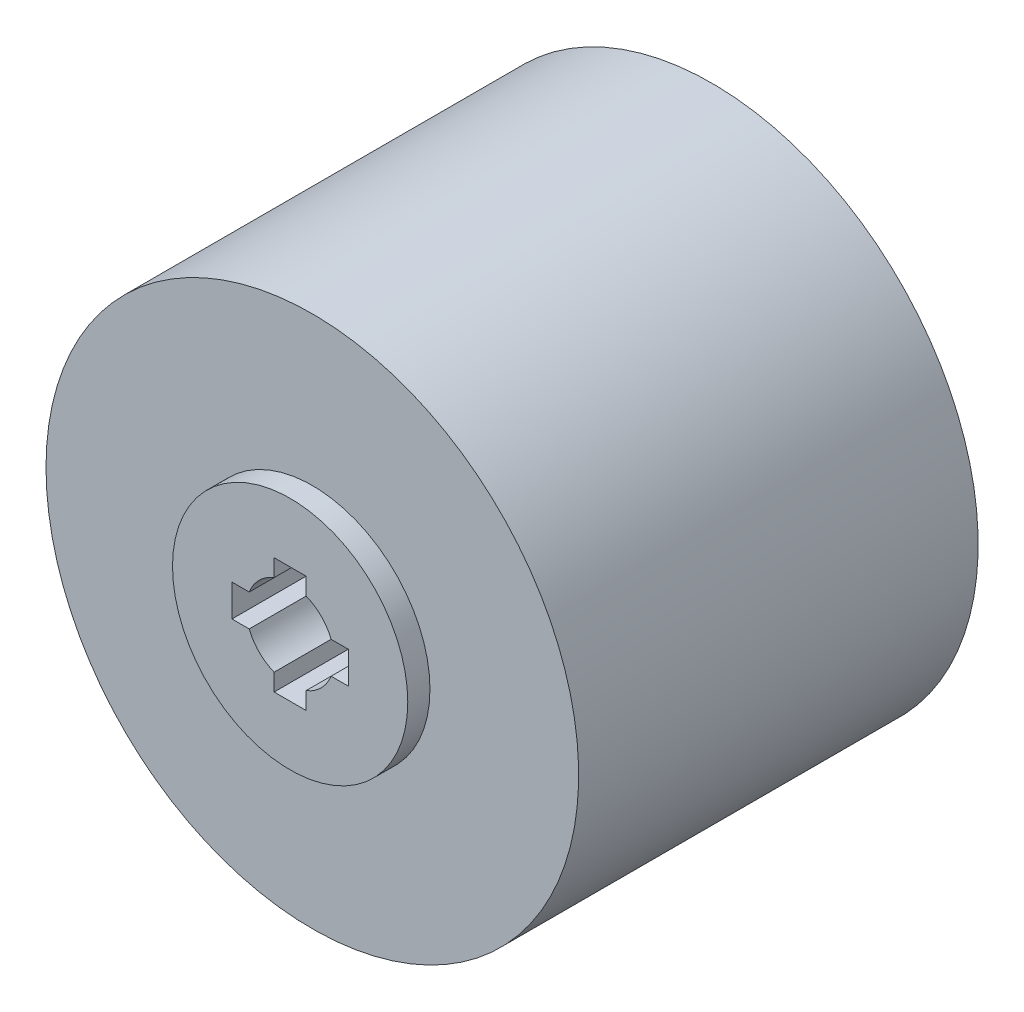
ISO-10303-21;
HEADER;
FILE_DESCRIPTION(('STEP AP214'),'2;1');
FILE_NAME('part.step','',(''),(''),'','','');
FILE_SCHEMA(('AUTOMOTIVE_DESIGN { 1 0 10303 214 1 1 1 1 }'));
ENDSEC;
DATA;
#1=APPLICATION_CONTEXT('core data for automotive mechanical design processes');
#2=APPLICATION_PROTOCOL_DEFINITION('international standard','automotive_design',2000,#1);
#3=PRODUCT_CONTEXT('',#1,'mechanical');
#4=PRODUCT('Part','Part','',(#3));
#5=PRODUCT_RELATED_PRODUCT_CATEGORY('part','',(#4));
#6=PRODUCT_DEFINITION_FORMATION('','',#4);
#7=PRODUCT_DEFINITION_CONTEXT('part definition',#1,'design');
#8=PRODUCT_DEFINITION('design','',#6,#7);
#9=PRODUCT_DEFINITION_SHAPE('','',#8);
#10=(LENGTH_UNIT() NAMED_UNIT(*) SI_UNIT(.MILLI.,.METRE.));
#11=(NAMED_UNIT(*) PLANE_ANGLE_UNIT() SI_UNIT($,.RADIAN.));
#12=(NAMED_UNIT(*) SI_UNIT($,.STERADIAN.) SOLID_ANGLE_UNIT());
#13=UNCERTAINTY_MEASURE_WITH_UNIT(LENGTH_MEASURE(1.E-05),#10,'distance_accuracy_value','');
#14=(GEOMETRIC_REPRESENTATION_CONTEXT(3) GLOBAL_UNCERTAINTY_ASSIGNED_CONTEXT((#13)) GLOBAL_UNIT_ASSIGNED_CONTEXT((#10,
#11,#12)) REPRESENTATION_CONTEXT('',''));
#15=CARTESIAN_POINT('',(0.,0.,0.));
#16=DIRECTION('',(0.,0.,1.));
#17=DIRECTION('',(1.,0.,0.));
#18=AXIS2_PLACEMENT_3D('',#15,#16,#17);
#19=CARTESIAN_POINT('',(0.,0.,50.));
#20=DIRECTION('',(0.,0.,-1.));
#21=DIRECTION('',(-1.,0.,0.));
#22=AXIS2_PLACEMENT_3D('',#19,#20,#21);
#23=CYLINDRICAL_SURFACE('',#22,26.5);
#24=CARTESIAN_POINT('',(0.,0.,50.));
#25=DIRECTION('',(0.,0.,1.));
#26=DIRECTION('',(1.,0.,0.));
#27=AXIS2_PLACEMENT_3D('',#24,#25,#26);
#28=CIRCLE('',#27,26.5);
#29=CARTESIAN_POINT('',(26.5,0.,50.));
#30=VERTEX_POINT('',#29);
#31=EDGE_CURVE('E102',#30,#30,#28,.T.);
#32=ORIENTED_EDGE('',*,*,#31,.F.);
#33=EDGE_LOOP('',(#32));
#34=FACE_BOUND('',#33,.T.);
#35=CARTESIAN_POINT('',(0.,0.,45.));
#36=DIRECTION('',(0.,0.,-1.));
#37=DIRECTION('',(-1.,0.,0.));
#38=AXIS2_PLACEMENT_3D('',#35,#36,#37);
#39=CIRCLE('',#38,26.5);
#40=CARTESIAN_POINT('',(-26.5,0.,45.));
#41=VERTEX_POINT('',#40);
#42=EDGE_CURVE('E12',#41,#41,#39,.T.);
#43=ORIENTED_EDGE('',*,*,#42,.F.);
#44=EDGE_LOOP('',(#43));
#45=FACE_BOUND('',#44,.T.);
#46=ADVANCED_FACE('F94',(#34,#45),#23,.T.);
#47=CARTESIAN_POINT('',(0.,0.,50.));
#48=DIRECTION('',(0.,0.,1.));
#49=DIRECTION('',(1.,0.,0.));
#50=AXIS2_PLACEMENT_3D('',#47,#48,#49);
#51=PLANE('',#50);
#52=DIRECTION('',(1.,0.,0.));
#53=VECTOR('',#52,1.);
#54=CARTESIAN_POINT('',(-13.1,-3.6,50.));
#55=LINE('',#54,#53);
#56=CARTESIAN_POINT('',(9.22225568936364,-3.6,50.));
#57=VERTEX_POINT('',#56);
#58=CARTESIAN_POINT('',(13.1,-3.6,50.));
#59=VERTEX_POINT('',#58);
#60=EDGE_CURVE('E281',#57,#59,#55,.T.);
#61=ORIENTED_EDGE('',*,*,#60,.F.);
#62=CARTESIAN_POINT('',(0.,0.,50.));
#63=DIRECTION('',(0.,0.,1.));
#64=DIRECTION('',(1.,0.,0.));
#65=AXIS2_PLACEMENT_3D('',#62,#63,#64);
#66=CIRCLE('',#65,9.9);
#67=CARTESIAN_POINT('',(3.6,-9.22225568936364,50.));
#68=VERTEX_POINT('',#67);
#69=EDGE_CURVE('E236',#68,#57,#66,.T.);
#70=ORIENTED_EDGE('',*,*,#69,.F.);
#71=DIRECTION('',(0.,-1.,0.));
#72=VECTOR('',#71,1.);
#73=CARTESIAN_POINT('',(3.6,13.1,50.));
#74=LINE('',#73,#72);
#75=CARTESIAN_POINT('',(3.6,-13.1,50.));
#76=VERTEX_POINT('',#75);
#77=EDGE_CURVE('E567',#68,#76,#74,.T.);
#78=ORIENTED_EDGE('',*,*,#77,.T.);
#79=DIRECTION('',(1.,0.,0.));
#80=VECTOR('',#79,1.);
#81=CARTESIAN_POINT('',(-3.6,-13.1,50.));
#82=LINE('',#81,#80);
#83=CARTESIAN_POINT('',(-3.6,-13.1,50.));
#84=VERTEX_POINT('',#83);
#85=EDGE_CURVE('E289',#84,#76,#82,.T.);
#86=ORIENTED_EDGE('',*,*,#85,.F.);
#87=DIRECTION('',(0.,-1.,0.));
#88=VECTOR('',#87,1.);
#89=CARTESIAN_POINT('',(-3.6,13.1,50.));
#90=LINE('',#89,#88);
#91=CARTESIAN_POINT('',(-3.6,-9.22225568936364,50.));
#92=VERTEX_POINT('',#91);
#93=EDGE_CURVE('E569',#92,#84,#90,.T.);
#94=ORIENTED_EDGE('',*,*,#93,.F.);
#95=CARTESIAN_POINT('',(-9.22225568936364,-3.6,50.));
#96=VERTEX_POINT('',#95);
#97=EDGE_CURVE('E241',#96,#92,#66,.T.);
#98=ORIENTED_EDGE('',*,*,#97,.F.);
#99=CARTESIAN_POINT('',(-13.1,-3.6,50.));
#100=VERTEX_POINT('',#99);
#101=EDGE_CURVE('E278',#100,#96,#55,.T.);
#102=ORIENTED_EDGE('',*,*,#101,.F.);
#103=DIRECTION('',(0.,-1.,0.));
#104=VECTOR('',#103,1.);
#105=CARTESIAN_POINT('',(-13.1,3.6,50.));
#106=LINE('',#105,#104);
#107=CARTESIAN_POINT('',(-13.1,3.6,50.));
#108=VERTEX_POINT('',#107);
#109=EDGE_CURVE('E284',#108,#100,#106,.T.);
#110=ORIENTED_EDGE('',*,*,#109,.F.);
#111=DIRECTION('',(1.,0.,0.));
#112=VECTOR('',#111,1.);
#113=CARTESIAN_POINT('',(-13.1,3.6,50.));
#114=LINE('',#113,#112);
#115=CARTESIAN_POINT('',(-9.22225568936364,3.6,50.));
#116=VERTEX_POINT('',#115);
#117=EDGE_CURVE('E224',#108,#116,#114,.T.);
#118=ORIENTED_EDGE('',*,*,#117,.T.);
#119=CARTESIAN_POINT('',(-3.6,9.22225568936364,50.));
#120=VERTEX_POINT('',#119);
#121=EDGE_CURVE('E234',#120,#116,#66,.T.);
#122=ORIENTED_EDGE('',*,*,#121,.F.);
#123=CARTESIAN_POINT('',(-3.6,13.1,50.));
#124=VERTEX_POINT('',#123);
#125=EDGE_CURVE('E257',#124,#120,#90,.T.);
#126=ORIENTED_EDGE('',*,*,#125,.F.);
#127=DIRECTION('',(1.,0.,0.));
#128=VECTOR('',#127,1.);
#129=CARTESIAN_POINT('',(-3.6,13.1,50.));
#130=LINE('',#129,#128);
#131=CARTESIAN_POINT('',(3.6,13.1,50.));
#132=VERTEX_POINT('',#131);
#133=EDGE_CURVE('E568',#124,#132,#130,.T.);
#134=ORIENTED_EDGE('',*,*,#133,.T.);
#135=CARTESIAN_POINT('',(3.6,9.22225568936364,50.));
#136=VERTEX_POINT('',#135);
#137=EDGE_CURVE('E232',#132,#136,#74,.T.);
#138=ORIENTED_EDGE('',*,*,#137,.T.);
#139=CARTESIAN_POINT('',(9.22225568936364,3.6,50.));
#140=VERTEX_POINT('',#139);
#141=EDGE_CURVE('E109',#140,#136,#66,.T.);
#142=ORIENTED_EDGE('',*,*,#141,.F.);
#143=CARTESIAN_POINT('',(13.1,3.6,50.));
#144=VERTEX_POINT('',#143);
#145=EDGE_CURVE('E217',#140,#144,#114,.T.);
#146=ORIENTED_EDGE('',*,*,#145,.T.);
#147=DIRECTION('',(0.,-1.,0.));
#148=VECTOR('',#147,1.);
#149=CARTESIAN_POINT('',(13.1,3.6,50.));
#150=LINE('',#149,#148);
#151=EDGE_CURVE('E225',#144,#59,#150,.T.);
#152=ORIENTED_EDGE('',*,*,#151,.T.);
#153=EDGE_LOOP('',(#61,#70,#78,#86,#94,#98,#102,#110,#118,#122,#126,#134,#138,#142,#146,#152));
#154=FACE_BOUND('',#153,.T.);
#155=ORIENTED_EDGE('',*,*,#31,.T.);
#156=EDGE_LOOP('',(#155));
#157=FACE_BOUND('',#156,.T.);
#158=ADVANCED_FACE('F229',(#154,#157),#51,.T.);
#159=CARTESIAN_POINT('',(0.,0.,45.));
#160=DIRECTION('',(0.,0.,-1.));
#161=DIRECTION('',(-1.,0.,0.));
#162=AXIS2_PLACEMENT_3D('',#159,#160,#161);
#163=CYLINDRICAL_SURFACE('',#162,60.);
#164=CARTESIAN_POINT('',(0.,0.,45.));
#165=DIRECTION('',(0.,0.,-1.));
#166=DIRECTION('',(-1.,0.,0.));
#167=AXIS2_PLACEMENT_3D('',#164,#165,#166);
#168=CIRCLE('',#167,60.);
#169=CARTESIAN_POINT('',(-60.,0.,45.));
#170=VERTEX_POINT('',#169);
#171=EDGE_CURVE('E313',#170,#170,#168,.T.);
#172=CARTESIAN_POINT('',(0.,0.,-45.));
#173=DIRECTION('',(0.,0.,-1.));
#174=DIRECTION('',(-1.,0.,0.));
#175=AXIS2_PLACEMENT_3D('',#172,#173,#174);
#176=CIRCLE('',#175,60.);
#177=CARTESIAN_POINT('',(-60.,0.,-45.));
#178=VERTEX_POINT('',#177);
#179=EDGE_CURVE('E307',#178,#178,#176,.T.);
#180=CARTESIAN_POINT('',(-60.,0.,45.));
#181=CARTESIAN_POINT('',(-60.,0.,44.0625));
#182=CARTESIAN_POINT('',(-60.,0.,43.125));
#183=CARTESIAN_POINT('',(-60.,0.,41.25));
#184=CARTESIAN_POINT('',(-60.,0.,40.3125));
#185=CARTESIAN_POINT('',(-60.,0.,38.4375));
#186=CARTESIAN_POINT('',(-60.,0.,37.5));
#187=CARTESIAN_POINT('',(-60.,0.,35.625));
#188=CARTESIAN_POINT('',(-60.,0.,34.6875));
#189=CARTESIAN_POINT('',(-60.,0.,32.8125));
#190=CARTESIAN_POINT('',(-60.,0.,31.875));
#191=CARTESIAN_POINT('',(-60.,0.,30.));
#192=CARTESIAN_POINT('',(-60.,0.,29.0625));
#193=CARTESIAN_POINT('',(-60.,0.,27.1875));
#194=CARTESIAN_POINT('',(-60.,0.,26.25));
#195=CARTESIAN_POINT('',(-60.,0.,24.375));
#196=CARTESIAN_POINT('',(-60.,0.,23.4375));
#197=CARTESIAN_POINT('',(-60.,0.,21.5625));
#198=CARTESIAN_POINT('',(-60.,0.,20.625));
#199=CARTESIAN_POINT('',(-60.,0.,18.75));
#200=CARTESIAN_POINT('',(-60.,0.,17.8125));
#201=CARTESIAN_POINT('',(-60.,0.,15.9375));
#202=CARTESIAN_POINT('',(-60.,0.,15.));
#203=CARTESIAN_POINT('',(-60.,0.,13.125));
#204=CARTESIAN_POINT('',(-60.,0.,12.1875));
#205=CARTESIAN_POINT('',(-60.,0.,10.3125));
#206=CARTESIAN_POINT('',(-60.,0.,9.37500000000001));
#207=CARTESIAN_POINT('',(-60.,0.,7.50000000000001));
#208=CARTESIAN_POINT('',(-60.,0.,6.56250000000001));
#209=CARTESIAN_POINT('',(-60.,0.,4.68750000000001));
#210=CARTESIAN_POINT('',(-60.,0.,3.75000000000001));
#211=CARTESIAN_POINT('',(-60.,0.,1.87500000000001));
#212=CARTESIAN_POINT('',(-60.,0.,0.937500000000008));
#213=CARTESIAN_POINT('',(-60.,0.,-0.937499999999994));
#214=CARTESIAN_POINT('',(-60.,0.,-1.87499999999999));
#215=CARTESIAN_POINT('',(-60.,0.,-3.74999999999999));
#216=CARTESIAN_POINT('',(-60.,0.,-4.68749999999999));
#217=CARTESIAN_POINT('',(-60.,0.,-6.56249999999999));
#218=CARTESIAN_POINT('',(-60.,0.,-7.49999999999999));
#219=CARTESIAN_POINT('',(-60.,0.,-9.37499999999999));
#220=CARTESIAN_POINT('',(-60.,0.,-10.3125));
#221=CARTESIAN_POINT('',(-60.,0.,-12.1875));
#222=CARTESIAN_POINT('',(-60.,0.,-13.125));
#223=CARTESIAN_POINT('',(-60.,0.,-15.));
#224=CARTESIAN_POINT('',(-60.,0.,-15.9375));
#225=CARTESIAN_POINT('',(-60.,0.,-17.8125));
#226=CARTESIAN_POINT('',(-60.,0.,-18.75));
#227=CARTESIAN_POINT('',(-60.,0.,-20.625));
#228=CARTESIAN_POINT('',(-60.,0.,-21.5625));
#229=CARTESIAN_POINT('',(-60.,0.,-23.4375));
#230=CARTESIAN_POINT('',(-60.,0.,-24.375));
#231=CARTESIAN_POINT('',(-60.,0.,-26.25));
#232=CARTESIAN_POINT('',(-60.,0.,-27.1875));
#233=CARTESIAN_POINT('',(-60.,0.,-29.0625));
#234=CARTESIAN_POINT('',(-60.,0.,-30.));
#235=CARTESIAN_POINT('',(-60.,0.,-31.875));
#236=CARTESIAN_POINT('',(-60.,0.,-32.8125));
#237=CARTESIAN_POINT('',(-60.,0.,-34.6875));
#238=CARTESIAN_POINT('',(-60.,0.,-35.625));
#239=CARTESIAN_POINT('',(-60.,0.,-37.5));
#240=CARTESIAN_POINT('',(-60.,0.,-38.4375));
#241=CARTESIAN_POINT('',(-60.,0.,-40.3125));
#242=CARTESIAN_POINT('',(-60.,0.,-41.25));
#243=CARTESIAN_POINT('',(-60.,0.,-43.125));
#244=CARTESIAN_POINT('',(-60.,0.,-44.0625));
#245=CARTESIAN_POINT('',(-60.,0.,-45.));
#246=B_SPLINE_CURVE_WITH_KNOTS('',3,(#180,#181,#182,#183,#184,#185,#186,#187,#188,#189,#190,
#191,#192,#193,#194,#195,#196,#197,#198,#199,#200,#201,#202,#203,#204,#205,#206,#207,#208,#209,
#210,#211,#212,#213,#214,#215,#216,#217,#218,#219,#220,#221,#222,#223,#224,#225,#226,#227,#228,
#229,#230,#231,#232,#233,#234,#235,#236,#237,#238,#239,#240,#241,#242,#243,#244,#245),
.UNSPECIFIED.,.F.,.F.,(4,2,2,2,2,2,2,2,2,2,2,2,2,2,2,2,2,2,2,2,2,2,2,2,2,2,2,2,2,2,2,2,4),(0.,
2.8125,5.625,8.43749999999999,11.25,14.0625,16.875,19.6875,22.5,25.3125,28.125,30.9375,33.75,
36.5625,39.375,42.1875,45.,47.8125,50.625,53.4375,56.25,59.0625,61.875,64.6875,67.5,70.3125,
73.125,75.9375,78.75,81.5625,84.375,87.1875,90.),.UNSPECIFIED.);
#247=EDGE_CURVE('BSEAM327',#170,#178,#246,.T.);
#248=ORIENTED_EDGE('',*,*,#171,.T.);
#249=ORIENTED_EDGE('',*,*,#179,.F.);
#250=ORIENTED_EDGE('',*,*,#247,.T.);
#251=ORIENTED_EDGE('',*,*,#247,.F.);
#252=EDGE_LOOP('',(#248,#250,#249,#251));
#253=FACE_BOUND('',#252,.T.);
#254=ADVANCED_FACE('F327',(#253),#163,.T.);
#255=CARTESIAN_POINT('',(0.,0.,45.));
#256=DIRECTION('',(0.,0.,-1.));
#257=DIRECTION('',(-1.,0.,0.));
#258=AXIS2_PLACEMENT_3D('',#255,#256,#257);
#259=PLANE('',#258);
#260=ORIENTED_EDGE('',*,*,#42,.T.);
#261=EDGE_LOOP('',(#260));
#262=FACE_BOUND('',#261,.T.);
#263=ORIENTED_EDGE('',*,*,#171,.F.);
#264=EDGE_LOOP('',(#263));
#265=FACE_BOUND('',#264,.T.);
#266=ADVANCED_FACE('F323',(#262,#265),#259,.F.);
#267=CARTESIAN_POINT('',(0.,0.,-45.));
#268=DIRECTION('',(0.,0.,1.));
#269=DIRECTION('',(-1.,0.,0.));
#270=AXIS2_PLACEMENT_3D('',#267,#268,#269);
#271=PLANE('',#270);
#272=CARTESIAN_POINT('',(0.,0.,-45.));
#273=DIRECTION('',(0.,0.,1.));
#274=DIRECTION('',(1.,0.,0.));
#275=AXIS2_PLACEMENT_3D('',#272,#273,#274);
#276=CIRCLE('',#275,26.5);
#277=CARTESIAN_POINT('',(26.5,0.,-45.));
#278=VERTEX_POINT('',#277);
#279=EDGE_CURVE('E97',#278,#278,#276,.F.);
#280=ORIENTED_EDGE('',*,*,#279,.F.);
#281=EDGE_LOOP('',(#280));
#282=FACE_BOUND('',#281,.T.);
#283=ORIENTED_EDGE('',*,*,#179,.T.);
#284=EDGE_LOOP('',(#283));
#285=FACE_BOUND('',#284,.T.);
#286=ADVANCED_FACE('F326',(#282,#285),#271,.F.);
#287=CARTESIAN_POINT('',(0.,0.,-50.));
#288=DIRECTION('',(0.,0.,-1.));
#289=DIRECTION('',(1.,0.,0.));
#290=AXIS2_PLACEMENT_3D('',#287,#288,#289);
#291=PLANE('',#290);
#292=DIRECTION('',(1.,0.,0.));
#293=VECTOR('',#292,1.);
#294=CARTESIAN_POINT('',(-13.1,-3.6,-50.));
#295=LINE('',#294,#293);
#296=CARTESIAN_POINT('',(9.22225568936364,-3.6,-50.));
#297=VERTEX_POINT('',#296);
#298=CARTESIAN_POINT('',(13.1,-3.6,-50.));
#299=VERTEX_POINT('',#298);
#300=EDGE_CURVE('E268',#297,#299,#295,.T.);
#301=ORIENTED_EDGE('',*,*,#300,.T.);
#302=DIRECTION('',(0.,-1.,0.));
#303=VECTOR('',#302,1.);
#304=CARTESIAN_POINT('',(13.1,3.6,-50.));
#305=LINE('',#304,#303);
#306=CARTESIAN_POINT('',(13.1,3.6,-50.));
#307=VERTEX_POINT('',#306);
#308=EDGE_CURVE('E267',#307,#299,#305,.T.);
#309=ORIENTED_EDGE('',*,*,#308,.F.);
#310=DIRECTION('',(1.,0.,0.));
#311=VECTOR('',#310,1.);
#312=CARTESIAN_POINT('',(-13.1,3.6,-50.));
#313=LINE('',#312,#311);
#314=CARTESIAN_POINT('',(9.22225568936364,3.6,-50.));
#315=VERTEX_POINT('',#314);
#316=EDGE_CURVE('E270',#315,#307,#313,.T.);
#317=ORIENTED_EDGE('',*,*,#316,.F.);
#318=CARTESIAN_POINT('',(0.,0.,-50.));
#319=DIRECTION('',(0.,0.,1.));
#320=DIRECTION('',(1.,0.,0.));
#321=AXIS2_PLACEMENT_3D('',#318,#319,#320);
#322=CIRCLE('',#321,9.9);
#323=CARTESIAN_POINT('',(3.6,9.22225568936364,-50.));
#324=VERTEX_POINT('',#323);
#325=EDGE_CURVE('E210',#315,#324,#322,.T.);
#326=ORIENTED_EDGE('',*,*,#325,.T.);
#327=DIRECTION('',(0.,-1.,0.));
#328=VECTOR('',#327,1.);
#329=CARTESIAN_POINT('',(3.6,13.1,-50.));
#330=LINE('',#329,#328);
#331=CARTESIAN_POINT('',(3.6,13.1,-50.));
#332=VERTEX_POINT('',#331);
#333=EDGE_CURVE('E541',#332,#324,#330,.T.);
#334=ORIENTED_EDGE('',*,*,#333,.F.);
#335=DIRECTION('',(1.,0.,0.));
#336=VECTOR('',#335,1.);
#337=CARTESIAN_POINT('',(-3.6,13.1,-50.));
#338=LINE('',#337,#336);
#339=CARTESIAN_POINT('',(-3.6,13.1,-50.));
#340=VERTEX_POINT('',#339);
#341=EDGE_CURVE('E543',#340,#332,#338,.T.);
#342=ORIENTED_EDGE('',*,*,#341,.F.);
#343=DIRECTION('',(0.,-1.,0.));
#344=VECTOR('',#343,1.);
#345=CARTESIAN_POINT('',(-3.6,13.1,-50.));
#346=LINE('',#345,#344);
#347=CARTESIAN_POINT('',(-3.6,9.22225568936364,-50.));
#348=VERTEX_POINT('',#347);
#349=EDGE_CURVE('E263',#340,#348,#346,.T.);
#350=ORIENTED_EDGE('',*,*,#349,.T.);
#351=CARTESIAN_POINT('',(-9.22225568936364,3.6,-50.));
#352=VERTEX_POINT('',#351);
#353=EDGE_CURVE('E549',#348,#352,#322,.T.);
#354=ORIENTED_EDGE('',*,*,#353,.T.);
#355=CARTESIAN_POINT('',(-13.1,3.6,-50.));
#356=VERTEX_POINT('',#355);
#357=EDGE_CURVE('E271',#356,#352,#313,.T.);
#358=ORIENTED_EDGE('',*,*,#357,.F.);
#359=DIRECTION('',(0.,-1.,0.));
#360=VECTOR('',#359,1.);
#361=CARTESIAN_POINT('',(-13.1,3.6,-50.));
#362=LINE('',#361,#360);
#363=CARTESIAN_POINT('',(-13.1,-3.6,-50.));
#364=VERTEX_POINT('',#363);
#365=EDGE_CURVE('E274',#356,#364,#362,.T.);
#366=ORIENTED_EDGE('',*,*,#365,.T.);
#367=CARTESIAN_POINT('',(-9.22225568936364,-3.6,-50.));
#368=VERTEX_POINT('',#367);
#369=EDGE_CURVE('E264',#364,#368,#295,.T.);
#370=ORIENTED_EDGE('',*,*,#369,.T.);
#371=CARTESIAN_POINT('',(-3.6,-9.22225568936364,-50.));
#372=VERTEX_POINT('',#371);
#373=EDGE_CURVE('E238',#368,#372,#322,.T.);
#374=ORIENTED_EDGE('',*,*,#373,.T.);
#375=CARTESIAN_POINT('',(-3.6,-13.1,-50.));
#376=VERTEX_POINT('',#375);
#377=EDGE_CURVE('E559',#372,#376,#346,.T.);
#378=ORIENTED_EDGE('',*,*,#377,.T.);
#379=DIRECTION('',(1.,0.,0.));
#380=VECTOR('',#379,1.);
#381=CARTESIAN_POINT('',(-3.6,-13.1,-50.));
#382=LINE('',#381,#380);
#383=CARTESIAN_POINT('',(3.6,-13.1,-50.));
#384=VERTEX_POINT('',#383);
#385=EDGE_CURVE('E573',#376,#384,#382,.T.);
#386=ORIENTED_EDGE('',*,*,#385,.T.);
#387=CARTESIAN_POINT('',(3.6,-9.22225568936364,-50.));
#388=VERTEX_POINT('',#387);
#389=EDGE_CURVE('E544',#388,#384,#330,.T.);
#390=ORIENTED_EDGE('',*,*,#389,.F.);
#391=EDGE_CURVE('E233',#388,#297,#322,.T.);
#392=ORIENTED_EDGE('',*,*,#391,.T.);
#393=EDGE_LOOP('',(#301,#309,#317,#326,#334,#342,#350,#354,#358,#366,#370,#374,#378,#386,#390,#392));
#394=FACE_BOUND('',#393,.T.);
#395=CARTESIAN_POINT('',(0.,0.,-50.));
#396=DIRECTION('',(0.,0.,1.));
#397=DIRECTION('',(1.,0.,0.));
#398=AXIS2_PLACEMENT_3D('',#395,#396,#397);
#399=CIRCLE('',#398,26.5);
#400=CARTESIAN_POINT('',(26.5,0.,-50.));
#401=VERTEX_POINT('',#400);
#402=EDGE_CURVE('E310',#401,#401,#399,.T.);
#403=ORIENTED_EDGE('',*,*,#402,.F.);
#404=EDGE_LOOP('',(#403));
#405=FACE_BOUND('',#404,.T.);
#406=ADVANCED_FACE('F337',(#394,#405),#291,.T.);
#407=CARTESIAN_POINT('',(0.,0.,-50.));
#408=DIRECTION('',(0.,0.,1.));
#409=DIRECTION('',(1.,0.,0.));
#410=AXIS2_PLACEMENT_3D('',#407,#408,#409);
#411=CYLINDRICAL_SURFACE('',#410,26.5);
#412=ORIENTED_EDGE('',*,*,#402,.T.);
#413=EDGE_LOOP('',(#412));
#414=FACE_BOUND('',#413,.T.);
#415=ORIENTED_EDGE('',*,*,#279,.T.);
#416=EDGE_LOOP('',(#415));
#417=FACE_BOUND('',#416,.T.);
#418=ADVANCED_FACE('F343',(#414,#417),#411,.T.);
#419=CARTESIAN_POINT('',(0.,0.,-50.));
#420=DIRECTION('',(0.,0.,1.));
#421=DIRECTION('',(1.,0.,0.));
#422=AXIS2_PLACEMENT_3D('',#419,#420,#421);
#423=CYLINDRICAL_SURFACE('',#422,9.9);
#424=DIRECTION('',(0.,0.,1.));
#425=VECTOR('',#424,1.);
#426=CARTESIAN_POINT('',(-3.6,-9.22225568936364,-50.));
#427=LINE('',#426,#425);
#428=EDGE_CURVE('E301',#92,#372,#427,.F.);
#429=ORIENTED_EDGE('',*,*,#428,.T.);
#430=ORIENTED_EDGE('',*,*,#373,.F.);
#431=DIRECTION('',(0.,0.,1.));
#432=VECTOR('',#431,1.);
#433=CARTESIAN_POINT('',(-9.22225568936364,-3.6,-50.));
#434=LINE('',#433,#432);
#435=EDGE_CURVE('E214',#368,#96,#434,.T.);
#436=ORIENTED_EDGE('',*,*,#435,.T.);
#437=ORIENTED_EDGE('',*,*,#97,.T.);
#438=EDGE_LOOP('',(#429,#430,#436,#437));
#439=FACE_BOUND('',#438,.T.);
#440=ADVANCED_FACE('F352',(#439),#423,.F.);
#441=DIRECTION('',(0.,0.,1.));
#442=VECTOR('',#441,1.);
#443=CARTESIAN_POINT('',(-3.6,9.22225568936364,-50.));
#444=LINE('',#443,#442);
#445=EDGE_CURVE('E305',#348,#120,#444,.T.);
#446=ORIENTED_EDGE('',*,*,#445,.T.);
#447=ORIENTED_EDGE('',*,*,#121,.T.);
#448=DIRECTION('',(0.,0.,1.));
#449=VECTOR('',#448,1.);
#450=CARTESIAN_POINT('',(-9.22225568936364,3.6,-50.));
#451=LINE('',#450,#449);
#452=EDGE_CURVE('E295',#352,#116,#451,.T.);
#453=ORIENTED_EDGE('',*,*,#452,.F.);
#454=ORIENTED_EDGE('',*,*,#353,.F.);
#455=EDGE_LOOP('',(#446,#447,#453,#454));
#456=FACE_BOUND('',#455,.T.);
#457=ADVANCED_FACE('F399',(#456),#423,.F.);
#458=CARTESIAN_POINT('',(-13.1,-3.6,-50.));
#459=DIRECTION('',(0.,-1.,0.));
#460=DIRECTION('',(0.,0.,-1.));
#461=AXIS2_PLACEMENT_3D('',#458,#459,#460);
#462=PLANE('',#461);
#463=ORIENTED_EDGE('',*,*,#369,.F.);
#464=DIRECTION('',(0.,0.,1.));
#465=VECTOR('',#464,1.);
#466=CARTESIAN_POINT('',(-13.1,-3.6,-50.));
#467=LINE('',#466,#465);
#468=EDGE_CURVE('E287',#364,#100,#467,.T.);
#469=ORIENTED_EDGE('',*,*,#468,.T.);
#470=ORIENTED_EDGE('',*,*,#101,.T.);
#471=ORIENTED_EDGE('',*,*,#435,.F.);
#472=EDGE_LOOP('',(#463,#469,#470,#471));
#473=FACE_BOUND('',#472,.T.);
#474=ADVANCED_FACE('F348',(#473),#462,.F.);
#475=CARTESIAN_POINT('',(-13.1,3.6,-50.));
#476=DIRECTION('',(-1.,0.,0.));
#477=DIRECTION('',(0.,0.,1.));
#478=AXIS2_PLACEMENT_3D('',#475,#476,#477);
#479=PLANE('',#478);
#480=ORIENTED_EDGE('',*,*,#109,.T.);
#481=ORIENTED_EDGE('',*,*,#468,.F.);
#482=ORIENTED_EDGE('',*,*,#365,.F.);
#483=DIRECTION('',(0.,0.,1.));
#484=VECTOR('',#483,1.);
#485=CARTESIAN_POINT('',(-13.1,3.6,-50.));
#486=LINE('',#485,#484);
#487=EDGE_CURVE('E290',#356,#108,#486,.T.);
#488=ORIENTED_EDGE('',*,*,#487,.T.);
#489=EDGE_LOOP('',(#480,#481,#482,#488));
#490=FACE_BOUND('',#489,.T.);
#491=ADVANCED_FACE('F415',(#490),#479,.F.);
#492=CARTESIAN_POINT('',(-13.1,3.6,-50.));
#493=DIRECTION('',(0.,-1.,0.));
#494=DIRECTION('',(0.,0.,-1.));
#495=AXIS2_PLACEMENT_3D('',#492,#493,#494);
#496=PLANE('',#495);
#497=ORIENTED_EDGE('',*,*,#452,.T.);
#498=ORIENTED_EDGE('',*,*,#117,.F.);
#499=ORIENTED_EDGE('',*,*,#487,.F.);
#500=ORIENTED_EDGE('',*,*,#357,.T.);
#501=EDGE_LOOP('',(#497,#498,#499,#500));
#502=FACE_BOUND('',#501,.T.);
#503=ADVANCED_FACE('F424',(#502),#496,.T.);
#504=ORIENTED_EDGE('',*,*,#69,.T.);
#505=DIRECTION('',(0.,0.,1.));
#506=VECTOR('',#505,1.);
#507=CARTESIAN_POINT('',(9.22225568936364,-3.6,-50.));
#508=LINE('',#507,#506);
#509=EDGE_CURVE('E213',#57,#297,#508,.F.);
#510=ORIENTED_EDGE('',*,*,#509,.T.);
#511=ORIENTED_EDGE('',*,*,#391,.F.);
#512=DIRECTION('',(0.,0.,1.));
#513=VECTOR('',#512,1.);
#514=CARTESIAN_POINT('',(3.6,-9.22225568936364,-50.));
#515=LINE('',#514,#513);
#516=EDGE_CURVE('E299',#68,#388,#515,.F.);
#517=ORIENTED_EDGE('',*,*,#516,.F.);
#518=EDGE_LOOP('',(#504,#510,#511,#517));
#519=FACE_BOUND('',#518,.T.);
#520=ADVANCED_FACE('F354',(#519),#423,.F.);
#521=ORIENTED_EDGE('',*,*,#325,.F.);
#522=DIRECTION('',(0.,0.,1.));
#523=VECTOR('',#522,1.);
#524=CARTESIAN_POINT('',(9.22225568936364,3.6,-50.));
#525=LINE('',#524,#523);
#526=EDGE_CURVE('E206',#140,#315,#525,.F.);
#527=ORIENTED_EDGE('',*,*,#526,.F.);
#528=ORIENTED_EDGE('',*,*,#141,.T.);
#529=DIRECTION('',(0.,0.,1.));
#530=VECTOR('',#529,1.);
#531=CARTESIAN_POINT('',(3.6,9.22225568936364,-50.));
#532=LINE('',#531,#530);
#533=EDGE_CURVE('E303',#324,#136,#532,.T.);
#534=ORIENTED_EDGE('',*,*,#533,.F.);
#535=EDGE_LOOP('',(#521,#527,#528,#534));
#536=FACE_BOUND('',#535,.T.);
#537=ADVANCED_FACE('F208',(#536),#423,.F.);
#538=ORIENTED_EDGE('',*,*,#526,.T.);
#539=ORIENTED_EDGE('',*,*,#316,.T.);
#540=DIRECTION('',(0.,0.,1.));
#541=VECTOR('',#540,1.);
#542=CARTESIAN_POINT('',(13.1,3.6,-50.));
#543=LINE('',#542,#541);
#544=EDGE_CURVE('E220',#307,#144,#543,.T.);
#545=ORIENTED_EDGE('',*,*,#544,.T.);
#546=ORIENTED_EDGE('',*,*,#145,.F.);
#547=EDGE_LOOP('',(#538,#539,#545,#546));
#548=FACE_BOUND('',#547,.T.);
#549=ADVANCED_FACE('F218',(#548),#496,.T.);
#550=CARTESIAN_POINT('',(13.1,3.6,-50.));
#551=DIRECTION('',(-1.,0.,0.));
#552=DIRECTION('',(0.,0.,1.));
#553=AXIS2_PLACEMENT_3D('',#550,#551,#552);
#554=PLANE('',#553);
#555=ORIENTED_EDGE('',*,*,#151,.F.);
#556=ORIENTED_EDGE('',*,*,#544,.F.);
#557=ORIENTED_EDGE('',*,*,#308,.T.);
#558=DIRECTION('',(0.,0.,1.));
#559=VECTOR('',#558,1.);
#560=CARTESIAN_POINT('',(13.1,-3.6,-50.));
#561=LINE('',#560,#559);
#562=EDGE_CURVE('E277',#299,#59,#561,.T.);
#563=ORIENTED_EDGE('',*,*,#562,.T.);
#564=EDGE_LOOP('',(#555,#556,#557,#563));
#565=FACE_BOUND('',#564,.T.);
#566=ADVANCED_FACE('F453',(#565),#554,.T.);
#567=ORIENTED_EDGE('',*,*,#60,.T.);
#568=ORIENTED_EDGE('',*,*,#562,.F.);
#569=ORIENTED_EDGE('',*,*,#300,.F.);
#570=ORIENTED_EDGE('',*,*,#509,.F.);
#571=EDGE_LOOP('',(#567,#568,#569,#570));
#572=FACE_BOUND('',#571,.T.);
#573=ADVANCED_FACE('F417',(#572),#462,.F.);
#574=CARTESIAN_POINT('',(3.6,13.1,-50.));
#575=DIRECTION('',(-1.,0.,0.));
#576=DIRECTION('',(0.,0.,1.));
#577=AXIS2_PLACEMENT_3D('',#574,#575,#576);
#578=PLANE('',#577);
#579=ORIENTED_EDGE('',*,*,#516,.T.);
#580=ORIENTED_EDGE('',*,*,#389,.T.);
#581=DIRECTION('',(0.,0.,1.));
#582=VECTOR('',#581,1.);
#583=CARTESIAN_POINT('',(3.6,-13.1,-50.));
#584=LINE('',#583,#582);
#585=EDGE_CURVE('E261',#384,#76,#584,.T.);
#586=ORIENTED_EDGE('',*,*,#585,.T.);
#587=ORIENTED_EDGE('',*,*,#77,.F.);
#588=EDGE_LOOP('',(#579,#580,#586,#587));
#589=FACE_BOUND('',#588,.T.);
#590=ADVANCED_FACE('F467',(#589),#578,.T.);
#591=CARTESIAN_POINT('',(-3.6,-13.1,-50.));
#592=DIRECTION('',(0.,-1.,0.));
#593=DIRECTION('',(0.,0.,-1.));
#594=AXIS2_PLACEMENT_3D('',#591,#592,#593);
#595=PLANE('',#594);
#596=ORIENTED_EDGE('',*,*,#85,.T.);
#597=ORIENTED_EDGE('',*,*,#585,.F.);
#598=ORIENTED_EDGE('',*,*,#385,.F.);
#599=DIRECTION('',(0.,0.,1.));
#600=VECTOR('',#599,1.);
#601=CARTESIAN_POINT('',(-3.6,-13.1,-50.));
#602=LINE('',#601,#600);
#603=EDGE_CURVE('E244',#376,#84,#602,.T.);
#604=ORIENTED_EDGE('',*,*,#603,.T.);
#605=EDGE_LOOP('',(#596,#597,#598,#604));
#606=FACE_BOUND('',#605,.T.);
#607=ADVANCED_FACE('F475',(#606),#595,.F.);
#608=CARTESIAN_POINT('',(-3.6,13.1,-50.));
#609=DIRECTION('',(-1.,0.,0.));
#610=DIRECTION('',(0.,0.,1.));
#611=AXIS2_PLACEMENT_3D('',#608,#609,#610);
#612=PLANE('',#611);
#613=ORIENTED_EDGE('',*,*,#93,.T.);
#614=ORIENTED_EDGE('',*,*,#603,.F.);
#615=ORIENTED_EDGE('',*,*,#377,.F.);
#616=ORIENTED_EDGE('',*,*,#428,.F.);
#617=EDGE_LOOP('',(#613,#614,#615,#616));
#618=FACE_BOUND('',#617,.T.);
#619=ADVANCED_FACE('F485',(#618),#612,.F.);
#620=ORIENTED_EDGE('',*,*,#349,.F.);
#621=DIRECTION('',(0.,0.,1.));
#622=VECTOR('',#621,1.);
#623=CARTESIAN_POINT('',(-3.6,13.1,-50.));
#624=LINE('',#623,#622);
#625=EDGE_CURVE('E249',#340,#124,#624,.T.);
#626=ORIENTED_EDGE('',*,*,#625,.T.);
#627=ORIENTED_EDGE('',*,*,#125,.T.);
#628=ORIENTED_EDGE('',*,*,#445,.F.);
#629=EDGE_LOOP('',(#620,#626,#627,#628));
#630=FACE_BOUND('',#629,.T.);
#631=ADVANCED_FACE('F493',(#630),#612,.F.);
#632=CARTESIAN_POINT('',(-3.6,13.1,-50.));
#633=DIRECTION('',(0.,-1.,0.));
#634=DIRECTION('',(0.,0.,-1.));
#635=AXIS2_PLACEMENT_3D('',#632,#633,#634);
#636=PLANE('',#635);
#637=ORIENTED_EDGE('',*,*,#133,.F.);
#638=ORIENTED_EDGE('',*,*,#625,.F.);
#639=ORIENTED_EDGE('',*,*,#341,.T.);
#640=DIRECTION('',(0.,0.,1.));
#641=VECTOR('',#640,1.);
#642=CARTESIAN_POINT('',(3.6,13.1,-50.));
#643=LINE('',#642,#641);
#644=EDGE_CURVE('E117',#332,#132,#643,.T.);
#645=ORIENTED_EDGE('',*,*,#644,.T.);
#646=EDGE_LOOP('',(#637,#638,#639,#645));
#647=FACE_BOUND('',#646,.T.);
#648=ADVANCED_FACE('F502',(#647),#636,.T.);
#649=ORIENTED_EDGE('',*,*,#533,.T.);
#650=ORIENTED_EDGE('',*,*,#137,.F.);
#651=ORIENTED_EDGE('',*,*,#644,.F.);
#652=ORIENTED_EDGE('',*,*,#333,.T.);
#653=EDGE_LOOP('',(#649,#650,#651,#652));
#654=FACE_BOUND('',#653,.T.);
#655=ADVANCED_FACE('F478',(#654),#578,.T.);
#656=CLOSED_SHELL('',(#46,#158,#254,#266,#286,#406,#418,#440,#457,#474,#491,#503,#520,#537,#549,
#566,#573,#590,#607,#619,#631,#648,#655));
#657=MANIFOLD_SOLID_BREP('B2',#656);
#658=ADVANCED_BREP_SHAPE_REPRESENTATION('',(#18,#657),#14);
#659=SHAPE_DEFINITION_REPRESENTATION(#9,#658);
ENDSEC;
END-ISO-10303-21;
